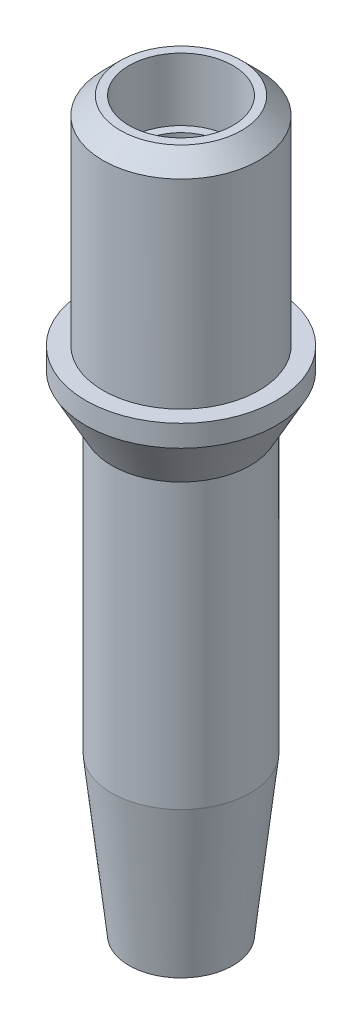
ISO-10303-21;
HEADER;
FILE_DESCRIPTION(('STEP AP214'),'2;1');
FILE_NAME('part.step','',(''),(''),'','','');
FILE_SCHEMA(('AUTOMOTIVE_DESIGN { 1 0 10303 214 1 1 1 1 }'));
ENDSEC;
DATA;
#1=APPLICATION_CONTEXT('core data for automotive mechanical design processes');
#2=APPLICATION_PROTOCOL_DEFINITION('international standard','automotive_design',2000,#1);
#3=PRODUCT_CONTEXT('',#1,'mechanical');
#4=PRODUCT('Part','Part','',(#3));
#5=PRODUCT_RELATED_PRODUCT_CATEGORY('part','',(#4));
#6=PRODUCT_DEFINITION_FORMATION('','',#4);
#7=PRODUCT_DEFINITION_CONTEXT('part definition',#1,'design');
#8=PRODUCT_DEFINITION('design','',#6,#7);
#9=PRODUCT_DEFINITION_SHAPE('','',#8);
#10=(LENGTH_UNIT() NAMED_UNIT(*) SI_UNIT(.MILLI.,.METRE.));
#11=(NAMED_UNIT(*) PLANE_ANGLE_UNIT() SI_UNIT($,.RADIAN.));
#12=(NAMED_UNIT(*) SI_UNIT($,.STERADIAN.) SOLID_ANGLE_UNIT());
#13=UNCERTAINTY_MEASURE_WITH_UNIT(LENGTH_MEASURE(1.E-05),#10,'distance_accuracy_value','');
#14=(GEOMETRIC_REPRESENTATION_CONTEXT(3) GLOBAL_UNCERTAINTY_ASSIGNED_CONTEXT((#13)) GLOBAL_UNIT_ASSIGNED_CONTEXT((#10,
#11,#12)) REPRESENTATION_CONTEXT('',''));
#15=CARTESIAN_POINT('',(0.,0.,0.));
#16=DIRECTION('',(0.,0.,1.));
#17=DIRECTION('',(1.,0.,0.));
#18=AXIS2_PLACEMENT_3D('',#15,#16,#17);
#19=CARTESIAN_POINT('',(0.,0.,0.));
#20=DIRECTION('',(0.,-1.,0.));
#21=DIRECTION('',(0.,0.,-1.));
#22=AXIS2_PLACEMENT_3D('',#19,#20,#21);
#23=CYLINDRICAL_SURFACE('',#22,36.);
#24=CARTESIAN_POINT('',(0.,92.0000000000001,0.));
#25=DIRECTION('',(0.,1.,0.));
#26=DIRECTION('',(0.,0.,1.));
#27=AXIS2_PLACEMENT_3D('',#24,#25,#26);
#28=CIRCLE('',#27,36.);
#29=CARTESIAN_POINT('',(0.,92.0000000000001,36.));
#30=VERTEX_POINT('',#29);
#31=EDGE_CURVE('E35',#30,#30,#28,.F.);
#32=ORIENTED_EDGE('',*,*,#31,.T.);
#33=EDGE_LOOP('',(#32));
#34=FACE_BOUND('',#33,.T.);
#35=CARTESIAN_POINT('',(0.,0.,0.));
#36=DIRECTION('',(0.,-1.,0.));
#37=DIRECTION('',(0.,0.,-1.));
#38=AXIS2_PLACEMENT_3D('',#35,#36,#37);
#39=CIRCLE('',#38,36.);
#40=CARTESIAN_POINT('',(0.,0.,-36.));
#41=VERTEX_POINT('',#40);
#42=EDGE_CURVE('E51',#41,#41,#39,.T.);
#43=ORIENTED_EDGE('',*,*,#42,.F.);
#44=EDGE_LOOP('',(#43));
#45=FACE_BOUND('',#44,.T.);
#46=ADVANCED_FACE('F29',(#34,#45),#23,.T.);
#47=CARTESIAN_POINT('',(36.,0.,0.));
#48=DIRECTION('',(0.,1.,0.));
#49=DIRECTION('',(0.,0.,1.));
#50=AXIS2_PLACEMENT_3D('',#47,#48,#49);
#51=PLANE('',#50);
#52=ORIENTED_EDGE('',*,*,#42,.T.);
#53=EDGE_LOOP('',(#52));
#54=FACE_BOUND('',#53,.T.);
#55=CARTESIAN_POINT('',(0.,0.,0.));
#56=DIRECTION('',(0.,-1.,0.));
#57=DIRECTION('',(0.,0.,-1.));
#58=AXIS2_PLACEMENT_3D('',#55,#56,#57);
#59=CIRCLE('',#58,44.);
#60=CARTESIAN_POINT('',(0.,0.,-44.0000000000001));
#61=VERTEX_POINT('',#60);
#62=EDGE_CURVE('E54',#61,#61,#59,.T.);
#63=ORIENTED_EDGE('',*,*,#62,.F.);
#64=EDGE_LOOP('',(#63));
#65=FACE_BOUND('',#64,.T.);
#66=ADVANCED_FACE('F111',(#54,#65),#51,.T.);
#67=CARTESIAN_POINT('',(0.,0.,0.));
#68=DIRECTION('',(0.,-1.,0.));
#69=DIRECTION('',(0.,0.,-1.));
#70=AXIS2_PLACEMENT_3D('',#67,#68,#69);
#71=CYLINDRICAL_SURFACE('',#70,44.);
#72=ORIENTED_EDGE('',*,*,#62,.T.);
#73=EDGE_LOOP('',(#72));
#74=FACE_BOUND('',#73,.T.);
#75=CARTESIAN_POINT('',(0.,-10.,0.));
#76=DIRECTION('',(0.,-1.,0.));
#77=DIRECTION('',(0.,0.,-1.));
#78=AXIS2_PLACEMENT_3D('',#75,#76,#77);
#79=CIRCLE('',#78,44.);
#80=CARTESIAN_POINT('',(0.,-10.,-44.0000000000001));
#81=VERTEX_POINT('',#80);
#82=EDGE_CURVE('E57',#81,#81,#79,.T.);
#83=ORIENTED_EDGE('',*,*,#82,.F.);
#84=EDGE_LOOP('',(#83));
#85=FACE_BOUND('',#84,.T.);
#86=ADVANCED_FACE('F115',(#74,#85),#71,.T.);
#87=CARTESIAN_POINT('',(0.,-32.,0.));
#88=DIRECTION('',(0.,1.,0.));
#89=DIRECTION('',(0.,0.,1.));
#90=AXIS2_PLACEMENT_3D('',#87,#88,#89);
#91=CONICAL_SURFACE('',#90,32.,0.499346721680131);
#92=ORIENTED_EDGE('',*,*,#82,.T.);
#93=EDGE_LOOP('',(#92));
#94=FACE_BOUND('',#93,.T.);
#95=CARTESIAN_POINT('',(0.,-32.,0.));
#96=DIRECTION('',(0.,-1.,0.));
#97=DIRECTION('',(0.,0.,-1.));
#98=AXIS2_PLACEMENT_3D('',#95,#96,#97);
#99=CIRCLE('',#98,32.);
#100=CARTESIAN_POINT('',(0.,-32.,-32.));
#101=VERTEX_POINT('',#100);
#102=EDGE_CURVE('E60',#101,#101,#99,.T.);
#103=ORIENTED_EDGE('',*,*,#102,.F.);
#104=EDGE_LOOP('',(#103));
#105=FACE_BOUND('',#104,.T.);
#106=ADVANCED_FACE('F124',(#94,#105),#91,.T.);
#107=CARTESIAN_POINT('',(0.,0.,0.));
#108=DIRECTION('',(0.,-1.,0.));
#109=DIRECTION('',(0.,0.,-1.));
#110=AXIS2_PLACEMENT_3D('',#107,#108,#109);
#111=CYLINDRICAL_SURFACE('',#110,32.);
#112=ORIENTED_EDGE('',*,*,#102,.T.);
#113=EDGE_LOOP('',(#112));
#114=FACE_BOUND('',#113,.T.);
#115=CARTESIAN_POINT('',(0.,-163.,0.));
#116=DIRECTION('',(0.,-1.,0.));
#117=DIRECTION('',(0.,0.,-1.));
#118=AXIS2_PLACEMENT_3D('',#115,#116,#117);
#119=CIRCLE('',#118,32.);
#120=CARTESIAN_POINT('',(0.,-163.,-32.0000000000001));
#121=VERTEX_POINT('',#120);
#122=EDGE_CURVE('E63',#121,#121,#119,.T.);
#123=ORIENTED_EDGE('',*,*,#122,.F.);
#124=EDGE_LOOP('',(#123));
#125=FACE_BOUND('',#124,.T.);
#126=ADVANCED_FACE('F130',(#114,#125),#111,.T.);
#127=CARTESIAN_POINT('',(0.,-236.,0.));
#128=DIRECTION('',(0.,1.,0.));
#129=DIRECTION('',(0.,0.,1.));
#130=AXIS2_PLACEMENT_3D('',#127,#128,#129);
#131=CONICAL_SURFACE('',#130,24.,0.109153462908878);
#132=ORIENTED_EDGE('',*,*,#122,.T.);
#133=EDGE_LOOP('',(#132));
#134=FACE_BOUND('',#133,.T.);
#135=CARTESIAN_POINT('',(0.,-236.,0.));
#136=DIRECTION('',(0.,-1.,0.));
#137=DIRECTION('',(0.,0.,-1.));
#138=AXIS2_PLACEMENT_3D('',#135,#136,#137);
#139=CIRCLE('',#138,24.);
#140=CARTESIAN_POINT('',(0.,-236.,-24.0000000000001));
#141=VERTEX_POINT('',#140);
#142=EDGE_CURVE('E66',#141,#141,#139,.T.);
#143=ORIENTED_EDGE('',*,*,#142,.F.);
#144=EDGE_LOOP('',(#143));
#145=FACE_BOUND('',#144,.T.);
#146=ADVANCED_FACE('F136',(#134,#145),#131,.T.);
#147=CARTESIAN_POINT('',(24.,-236.,0.));
#148=DIRECTION('',(0.,-1.,0.));
#149=DIRECTION('',(0.,0.,-1.));
#150=AXIS2_PLACEMENT_3D('',#147,#148,#149);
#151=PLANE('',#150);
#152=ORIENTED_EDGE('',*,*,#142,.T.);
#153=EDGE_LOOP('',(#152));
#154=FACE_BOUND('',#153,.T.);
#155=CARTESIAN_POINT('',(0.,-236.,0.));
#156=DIRECTION('',(0.,-1.,0.));
#157=DIRECTION('',(0.,0.,-1.));
#158=AXIS2_PLACEMENT_3D('',#155,#156,#157);
#159=CIRCLE('',#158,13.);
#160=CARTESIAN_POINT('',(0.,-236.,-13.));
#161=VERTEX_POINT('',#160);
#162=EDGE_CURVE('E69',#161,#161,#159,.T.);
#163=ORIENTED_EDGE('',*,*,#162,.F.);
#164=EDGE_LOOP('',(#163));
#165=FACE_BOUND('',#164,.T.);
#166=ADVANCED_FACE('F142',(#154,#165),#151,.T.);
#167=CARTESIAN_POINT('',(0.,0.,0.));
#168=DIRECTION('',(0.,-1.,0.));
#169=DIRECTION('',(0.,0.,-1.));
#170=AXIS2_PLACEMENT_3D('',#167,#168,#169);
#171=CYLINDRICAL_SURFACE('',#170,13.);
#172=ORIENTED_EDGE('',*,*,#162,.T.);
#173=EDGE_LOOP('',(#172));
#174=FACE_BOUND('',#173,.T.);
#175=CARTESIAN_POINT('',(0.,-206.,0.));
#176=DIRECTION('',(0.,-1.,0.));
#177=DIRECTION('',(0.,0.,-1.));
#178=AXIS2_PLACEMENT_3D('',#175,#176,#177);
#179=CIRCLE('',#178,13.);
#180=CARTESIAN_POINT('',(0.,-206.,-13.));
#181=VERTEX_POINT('',#180);
#182=EDGE_CURVE('E72',#181,#181,#179,.T.);
#183=ORIENTED_EDGE('',*,*,#182,.F.);
#184=EDGE_LOOP('',(#183));
#185=FACE_BOUND('',#184,.T.);
#186=ADVANCED_FACE('F148',(#174,#185),#171,.F.);
#187=CARTESIAN_POINT('',(13.,-206.,0.));
#188=DIRECTION('',(0.,1.,0.));
#189=DIRECTION('',(0.,0.,1.));
#190=AXIS2_PLACEMENT_3D('',#187,#188,#189);
#191=PLANE('',#190);
#192=CARTESIAN_POINT('',(0.,-206.,0.));
#193=DIRECTION('',(0.,1.,0.));
#194=DIRECTION('',(0.,0.,1.));
#195=AXIS2_PLACEMENT_3D('',#192,#193,#194);
#196=CIRCLE('',#195,14.);
#197=CARTESIAN_POINT('',(0.,-206.,14.));
#198=VERTEX_POINT('',#197);
#199=EDGE_CURVE('E43',#198,#198,#196,.T.);
#200=ORIENTED_EDGE('',*,*,#199,.T.);
#201=EDGE_LOOP('',(#200));
#202=FACE_BOUND('',#201,.T.);
#203=ORIENTED_EDGE('',*,*,#182,.T.);
#204=EDGE_LOOP('',(#203));
#205=FACE_BOUND('',#204,.T.);
#206=ADVANCED_FACE('F154',(#202,#205),#191,.T.);
#207=CARTESIAN_POINT('',(0.,0.,0.));
#208=DIRECTION('',(0.,-1.,0.));
#209=DIRECTION('',(0.,0.,-1.));
#210=AXIS2_PLACEMENT_3D('',#207,#208,#209);
#211=CYLINDRICAL_SURFACE('',#210,20.);
#212=CARTESIAN_POINT('',(0.,-29.4641016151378,0.));
#213=DIRECTION('',(0.,1.,0.));
#214=DIRECTION('',(0.,0.,1.));
#215=AXIS2_PLACEMENT_3D('',#212,#213,#214);
#216=CIRCLE('',#215,20.);
#217=CARTESIAN_POINT('',(0.,-29.4641016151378,20.));
#218=VERTEX_POINT('',#217);
#219=EDGE_CURVE('E39',#218,#218,#216,.T.);
#220=ORIENTED_EDGE('',*,*,#219,.T.);
#221=EDGE_LOOP('',(#220));
#222=FACE_BOUND('',#221,.T.);
#223=CARTESIAN_POINT('',(0.,-200.,0.));
#224=DIRECTION('',(0.,1.,0.));
#225=DIRECTION('',(0.,0.,1.));
#226=AXIS2_PLACEMENT_3D('',#223,#224,#225);
#227=CIRCLE('',#226,20.);
#228=CARTESIAN_POINT('',(0.,-200.,20.));
#229=VERTEX_POINT('',#228);
#230=EDGE_CURVE('E48',#229,#229,#227,.F.);
#231=ORIENTED_EDGE('',*,*,#230,.T.);
#232=EDGE_LOOP('',(#231));
#233=FACE_BOUND('',#232,.T.);
#234=ADVANCED_FACE('F159',(#222,#233),#211,.F.);
#235=CARTESIAN_POINT('',(0.,0.,0.));
#236=DIRECTION('',(0.,-1.,0.));
#237=DIRECTION('',(0.,0.,-1.));
#238=AXIS2_PLACEMENT_3D('',#235,#236,#237);
#239=CYLINDRICAL_SURFACE('',#238,18.);
#240=CARTESIAN_POINT('',(0.,-26.,0.));
#241=DIRECTION('',(0.,-1.,0.));
#242=DIRECTION('',(0.,0.,-1.));
#243=AXIS2_PLACEMENT_3D('',#240,#241,#242);
#244=CIRCLE('',#243,18.);
#245=CARTESIAN_POINT('',(0.,-26.,-18.));
#246=VERTEX_POINT('',#245);
#247=EDGE_CURVE('E75',#246,#246,#244,.T.);
#248=ORIENTED_EDGE('',*,*,#247,.T.);
#249=EDGE_LOOP('',(#248));
#250=FACE_BOUND('',#249,.T.);
#251=CARTESIAN_POINT('',(0.,-20.6219092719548,0.));
#252=DIRECTION('',(0.,-1.,0.));
#253=DIRECTION('',(0.,0.,-1.));
#254=AXIS2_PLACEMENT_3D('',#251,#252,#253);
#255=CIRCLE('',#254,18.);
#256=CARTESIAN_POINT('',(0.,-20.6219092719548,-18.));
#257=VERTEX_POINT('',#256);
#258=EDGE_CURVE('E78',#257,#257,#255,.T.);
#259=ORIENTED_EDGE('',*,*,#258,.F.);
#260=EDGE_LOOP('',(#259));
#261=FACE_BOUND('',#260,.T.);
#262=ADVANCED_FACE('F165',(#250,#261),#239,.F.);
#263=CARTESIAN_POINT('',(0.,6.00000000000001,0.));
#264=DIRECTION('',(0.,1.,0.));
#265=DIRECTION('',(0.,0.,1.));
#266=AXIS2_PLACEMENT_3D('',#263,#264,#265);
#267=CONICAL_SURFACE('',#266,20.,0.0749852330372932);
#268=ORIENTED_EDGE('',*,*,#258,.T.);
#269=EDGE_LOOP('',(#268));
#270=FACE_BOUND('',#269,.T.);
#271=CARTESIAN_POINT('',(0.,6.00000000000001,0.));
#272=DIRECTION('',(0.,-1.,0.));
#273=DIRECTION('',(0.,0.,-1.));
#274=AXIS2_PLACEMENT_3D('',#271,#272,#273);
#275=CIRCLE('',#274,20.);
#276=CARTESIAN_POINT('',(0.,6.00000000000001,-20.));
#277=VERTEX_POINT('',#276);
#278=EDGE_CURVE('E81',#277,#277,#275,.T.);
#279=ORIENTED_EDGE('',*,*,#278,.F.);
#280=EDGE_LOOP('',(#279));
#281=FACE_BOUND('',#280,.T.);
#282=ADVANCED_FACE('F171',(#270,#281),#267,.F.);
#283=CARTESIAN_POINT('',(0.,0.,0.));
#284=DIRECTION('',(0.,-1.,0.));
#285=DIRECTION('',(0.,0.,-1.));
#286=AXIS2_PLACEMENT_3D('',#283,#284,#285);
#287=CYLINDRICAL_SURFACE('',#286,20.);
#288=ORIENTED_EDGE('',*,*,#278,.T.);
#289=EDGE_LOOP('',(#288));
#290=FACE_BOUND('',#289,.T.);
#291=CARTESIAN_POINT('',(0.,71.,0.));
#292=DIRECTION('',(0.,-1.,0.));
#293=DIRECTION('',(0.,0.,-1.));
#294=AXIS2_PLACEMENT_3D('',#291,#292,#293);
#295=CIRCLE('',#294,20.);
#296=CARTESIAN_POINT('',(0.,71.,-20.));
#297=VERTEX_POINT('',#296);
#298=EDGE_CURVE('E84',#297,#297,#295,.T.);
#299=ORIENTED_EDGE('',*,*,#298,.F.);
#300=EDGE_LOOP('',(#299));
#301=FACE_BOUND('',#300,.T.);
#302=ADVANCED_FACE('F107',(#290,#301),#287,.F.);
#303=CARTESIAN_POINT('',(20.,71.,0.));
#304=DIRECTION('',(0.,1.,0.));
#305=DIRECTION('',(0.,0.,1.));
#306=AXIS2_PLACEMENT_3D('',#303,#304,#305);
#307=PLANE('',#306);
#308=ORIENTED_EDGE('',*,*,#298,.T.);
#309=EDGE_LOOP('',(#308));
#310=FACE_BOUND('',#309,.T.);
#311=CARTESIAN_POINT('',(0.,71.,0.));
#312=DIRECTION('',(0.,-1.,0.));
#313=DIRECTION('',(0.,0.,-1.));
#314=AXIS2_PLACEMENT_3D('',#311,#312,#313);
#315=CIRCLE('',#314,24.);
#316=CARTESIAN_POINT('',(0.,71.,-24.));
#317=VERTEX_POINT('',#316);
#318=EDGE_CURVE('E87',#317,#317,#315,.T.);
#319=ORIENTED_EDGE('',*,*,#318,.F.);
#320=EDGE_LOOP('',(#319));
#321=FACE_BOUND('',#320,.T.);
#322=ADVANCED_FACE('F98',(#310,#321),#307,.T.);
#323=CARTESIAN_POINT('',(0.,0.,0.));
#324=DIRECTION('',(0.,-1.,0.));
#325=DIRECTION('',(0.,0.,-1.));
#326=AXIS2_PLACEMENT_3D('',#323,#324,#325);
#327=CYLINDRICAL_SURFACE('',#326,24.);
#328=ORIENTED_EDGE('',*,*,#318,.T.);
#329=EDGE_LOOP('',(#328));
#330=FACE_BOUND('',#329,.T.);
#331=CARTESIAN_POINT('',(0.,100.,0.));
#332=DIRECTION('',(0.,-1.,0.));
#333=DIRECTION('',(0.,0.,-1.));
#334=AXIS2_PLACEMENT_3D('',#331,#332,#333);
#335=CIRCLE('',#334,24.);
#336=CARTESIAN_POINT('',(0.,100.,-24.));
#337=VERTEX_POINT('',#336);
#338=EDGE_CURVE('E90',#337,#337,#335,.T.);
#339=ORIENTED_EDGE('',*,*,#338,.F.);
#340=EDGE_LOOP('',(#339));
#341=FACE_BOUND('',#340,.T.);
#342=ADVANCED_FACE('F96',(#330,#341),#327,.F.);
#343=CARTESIAN_POINT('',(24.,100.,0.));
#344=DIRECTION('',(0.,1.,0.));
#345=DIRECTION('',(0.,0.,1.));
#346=AXIS2_PLACEMENT_3D('',#343,#344,#345);
#347=PLANE('',#346);
#348=CARTESIAN_POINT('',(0.,100.,0.));
#349=DIRECTION('',(0.,1.,0.));
#350=DIRECTION('',(0.,0.,1.));
#351=AXIS2_PLACEMENT_3D('',#348,#349,#350);
#352=CIRCLE('',#351,28.);
#353=CARTESIAN_POINT('',(0.,100.,28.));
#354=VERTEX_POINT('',#353);
#355=EDGE_CURVE('E10',#354,#354,#352,.T.);
#356=ORIENTED_EDGE('',*,*,#355,.T.);
#357=EDGE_LOOP('',(#356));
#358=FACE_BOUND('',#357,.T.);
#359=ORIENTED_EDGE('',*,*,#338,.T.);
#360=EDGE_LOOP('',(#359));
#361=FACE_BOUND('',#360,.T.);
#362=ADVANCED_FACE('F94',(#358,#361),#347,.T.);
#363=CARTESIAN_POINT('',(0.,-200.,0.));
#364=DIRECTION('',(0.,1.,0.));
#365=DIRECTION('',(0.,0.,1.));
#366=AXIS2_PLACEMENT_3D('',#363,#364,#365);
#367=CONICAL_SURFACE('',#366,20.,0.785398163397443);
#368=ORIENTED_EDGE('',*,*,#199,.F.);
#369=EDGE_LOOP('',(#368));
#370=FACE_BOUND('',#369,.T.);
#371=ORIENTED_EDGE('',*,*,#230,.F.);
#372=EDGE_LOOP('',(#371));
#373=FACE_BOUND('',#372,.T.);
#374=ADVANCED_FACE('F105',(#370,#373),#367,.F.);
#375=CARTESIAN_POINT('',(0.,-29.4641016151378,0.));
#376=DIRECTION('',(0.,1.,0.));
#377=DIRECTION('',(0.,0.,1.));
#378=AXIS2_PLACEMENT_3D('',#375,#376,#377);
#379=TOROIDAL_SURFACE('',#378,16.,4.);
#380=ORIENTED_EDGE('',*,*,#219,.F.);
#381=EDGE_LOOP('',(#380));
#382=FACE_BOUND('',#381,.T.);
#383=ORIENTED_EDGE('',*,*,#247,.F.);
#384=EDGE_LOOP('',(#383));
#385=FACE_BOUND('',#384,.T.);
#386=ADVANCED_FACE('F207',(#382,#385),#379,.F.);
#387=CARTESIAN_POINT('',(0.,92.0000000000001,0.));
#388=DIRECTION('',(0.,-1.,0.));
#389=DIRECTION('',(0.,0.,-1.));
#390=AXIS2_PLACEMENT_3D('',#387,#388,#389);
#391=CONICAL_SURFACE('',#390,36.,0.785398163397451);
#392=ORIENTED_EDGE('',*,*,#355,.F.);
#393=EDGE_LOOP('',(#392));
#394=FACE_BOUND('',#393,.T.);
#395=ORIENTED_EDGE('',*,*,#31,.F.);
#396=EDGE_LOOP('',(#395));
#397=FACE_BOUND('',#396,.T.);
#398=ADVANCED_FACE('F215',(#394,#397),#391,.T.);
#399=CLOSED_SHELL('',(#46,#66,#86,#106,#126,#146,#166,#186,#206,#234,#262,#282,#302,#322,#342,
#362,#374,#386,#398));
#400=MANIFOLD_SOLID_BREP('B2',#399);
#401=ADVANCED_BREP_SHAPE_REPRESENTATION('',(#18,#400),#14);
#402=SHAPE_DEFINITION_REPRESENTATION(#9,#401);
ENDSEC;
END-ISO-10303-21;
